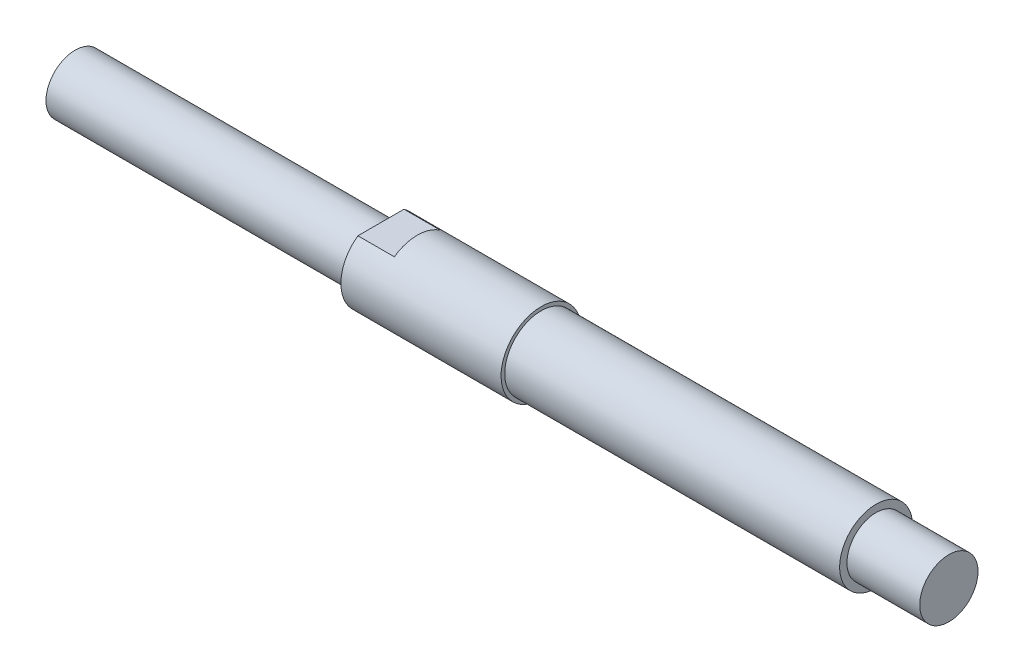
ISO-10303-21;
HEADER;
FILE_DESCRIPTION(('STEP AP214'),'2;1');
FILE_NAME('part.step','',(''),(''),'','','');
FILE_SCHEMA(('AUTOMOTIVE_DESIGN { 1 0 10303 214 1 1 1 1 }'));
ENDSEC;
DATA;
#1=APPLICATION_CONTEXT('core data for automotive mechanical design processes');
#2=APPLICATION_PROTOCOL_DEFINITION('international standard','automotive_design',2000,#1);
#3=PRODUCT_CONTEXT('',#1,'mechanical');
#4=PRODUCT('Part','Part','',(#3));
#5=PRODUCT_RELATED_PRODUCT_CATEGORY('part','',(#4));
#6=PRODUCT_DEFINITION_FORMATION('','',#4);
#7=PRODUCT_DEFINITION_CONTEXT('part definition',#1,'design');
#8=PRODUCT_DEFINITION('design','',#6,#7);
#9=PRODUCT_DEFINITION_SHAPE('','',#8);
#10=(LENGTH_UNIT() NAMED_UNIT(*) SI_UNIT(.MILLI.,.METRE.));
#11=(NAMED_UNIT(*) PLANE_ANGLE_UNIT() SI_UNIT($,.RADIAN.));
#12=(NAMED_UNIT(*) SI_UNIT($,.STERADIAN.) SOLID_ANGLE_UNIT());
#13=UNCERTAINTY_MEASURE_WITH_UNIT(LENGTH_MEASURE(1.E-05),#10,'distance_accuracy_value','');
#14=(GEOMETRIC_REPRESENTATION_CONTEXT(3) GLOBAL_UNCERTAINTY_ASSIGNED_CONTEXT((#13)) GLOBAL_UNIT_ASSIGNED_CONTEXT((#10,
#11,#12)) REPRESENTATION_CONTEXT('',''));
#15=CARTESIAN_POINT('',(0.,0.,0.));
#16=DIRECTION('',(0.,0.,1.));
#17=DIRECTION('',(1.,0.,0.));
#18=AXIS2_PLACEMENT_3D('',#15,#16,#17);
#19=CARTESIAN_POINT('',(-2.91291976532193,0.,0.));
#20=DIRECTION('',(-1.,0.,0.));
#21=DIRECTION('',(0.,0.,1.));
#22=AXIS2_PLACEMENT_3D('',#19,#20,#21);
#23=CYLINDRICAL_SURFACE('',#22,2.75);
#24=CARTESIAN_POINT('',(32.,0.,0.));
#25=DIRECTION('',(1.,0.,0.));
#26=DIRECTION('',(0.,0.,-1.));
#27=AXIS2_PLACEMENT_3D('',#24,#25,#26);
#28=CIRCLE('',#27,2.75);
#29=CARTESIAN_POINT('',(32.,0.,-2.75));
#30=VERTEX_POINT('',#29);
#31=EDGE_CURVE('E127',#30,#30,#28,.T.);
#32=ORIENTED_EDGE('',*,*,#31,.F.);
#33=EDGE_LOOP('',(#32));
#34=FACE_BOUND('',#33,.T.);
#35=CARTESIAN_POINT('',(23.5,0.,0.));
#36=DIRECTION('',(-1.,0.,0.));
#37=DIRECTION('',(0.,0.,1.));
#38=AXIS2_PLACEMENT_3D('',#35,#36,#37);
#39=CIRCLE('',#38,2.75);
#40=CARTESIAN_POINT('',(23.5,2.25,1.58113883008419));
#41=VERTEX_POINT('',#40);
#42=CARTESIAN_POINT('',(23.5,2.25,-1.58113883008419));
#43=VERTEX_POINT('',#42);
#44=EDGE_CURVE('E13',#41,#43,#39,.T.);
#45=ORIENTED_EDGE('',*,*,#44,.F.);
#46=DIRECTION('',(-1.,0.,0.));
#47=VECTOR('',#46,1.);
#48=CARTESIAN_POINT('',(-2.91291976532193,2.25,1.58113883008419));
#49=LINE('',#48,#47);
#50=CARTESIAN_POINT('',(21.,2.25,1.58113883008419));
#51=VERTEX_POINT('',#50);
#52=EDGE_CURVE('E99',#51,#41,#49,.F.);
#53=ORIENTED_EDGE('',*,*,#52,.F.);
#54=CARTESIAN_POINT('',(21.,0.,0.));
#55=DIRECTION('',(-1.,0.,0.));
#56=DIRECTION('',(0.,0.,1.));
#57=AXIS2_PLACEMENT_3D('',#54,#55,#56);
#58=CIRCLE('',#57,2.75);
#59=CARTESIAN_POINT('',(21.,-2.25,1.58113883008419));
#60=VERTEX_POINT('',#59);
#61=EDGE_CURVE('E108',#60,#51,#58,.T.);
#62=ORIENTED_EDGE('',*,*,#61,.F.);
#63=DIRECTION('',(-1.,0.,0.));
#64=VECTOR('',#63,1.);
#65=CARTESIAN_POINT('',(-2.91291976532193,-2.25,1.58113883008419));
#66=LINE('',#65,#64);
#67=CARTESIAN_POINT('',(23.5,-2.25,1.58113883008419));
#68=VERTEX_POINT('',#67);
#69=EDGE_CURVE('E168',#68,#60,#66,.T.);
#70=ORIENTED_EDGE('',*,*,#69,.F.);
#71=CARTESIAN_POINT('',(23.5,0.,0.));
#72=DIRECTION('',(-1.,0.,0.));
#73=DIRECTION('',(0.,0.,1.));
#74=AXIS2_PLACEMENT_3D('',#71,#72,#73);
#75=CIRCLE('',#74,2.75);
#76=CARTESIAN_POINT('',(23.5,-2.25,-1.58113883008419));
#77=VERTEX_POINT('',#76);
#78=EDGE_CURVE('E138',#77,#68,#75,.T.);
#79=ORIENTED_EDGE('',*,*,#78,.F.);
#80=DIRECTION('',(-1.,0.,0.));
#81=VECTOR('',#80,1.);
#82=CARTESIAN_POINT('',(-2.91291976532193,-2.25,-1.58113883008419));
#83=LINE('',#82,#81);
#84=CARTESIAN_POINT('',(21.,-2.25,-1.58113883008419));
#85=VERTEX_POINT('',#84);
#86=EDGE_CURVE('E161',#85,#77,#83,.F.);
#87=ORIENTED_EDGE('',*,*,#86,.F.);
#88=CARTESIAN_POINT('',(21.,2.25,-1.58113883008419));
#89=VERTEX_POINT('',#88);
#90=EDGE_CURVE('E116',#89,#85,#58,.T.);
#91=ORIENTED_EDGE('',*,*,#90,.F.);
#92=DIRECTION('',(-1.,0.,0.));
#93=VECTOR('',#92,1.);
#94=CARTESIAN_POINT('',(-2.91291976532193,2.25,-1.58113883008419));
#95=LINE('',#94,#93);
#96=EDGE_CURVE('E61',#43,#89,#95,.T.);
#97=ORIENTED_EDGE('',*,*,#96,.F.);
#98=EDGE_LOOP('',(#45,#53,#62,#70,#79,#87,#91,#97));
#99=FACE_BOUND('',#98,.T.);
#100=ADVANCED_FACE('F46',(#34,#99),#23,.T.);
#101=CARTESIAN_POINT('',(21.,0.,0.));
#102=DIRECTION('',(-1.,0.,0.));
#103=DIRECTION('',(0.,0.,1.));
#104=AXIS2_PLACEMENT_3D('',#101,#102,#103);
#105=PLANE('',#104);
#106=CARTESIAN_POINT('',(21.,0.,0.));
#107=DIRECTION('',(-1.,0.,0.));
#108=DIRECTION('',(0.,0.,1.));
#109=AXIS2_PLACEMENT_3D('',#106,#107,#108);
#110=CIRCLE('',#109,2.);
#111=CARTESIAN_POINT('',(21.,0.,2.));
#112=VERTEX_POINT('',#111);
#113=EDGE_CURVE('E121',#112,#112,#110,.T.);
#114=ORIENTED_EDGE('',*,*,#113,.F.);
#115=EDGE_LOOP('',(#114));
#116=FACE_BOUND('',#115,.T.);
#117=ORIENTED_EDGE('',*,*,#61,.T.);
#118=DIRECTION('',(0.,0.,-1.));
#119=VECTOR('',#118,1.);
#120=CARTESIAN_POINT('',(21.,2.25,0.));
#121=LINE('',#120,#119);
#122=EDGE_CURVE('E54',#51,#89,#121,.T.);
#123=ORIENTED_EDGE('',*,*,#122,.T.);
#124=ORIENTED_EDGE('',*,*,#90,.T.);
#125=DIRECTION('',(0.,0.,1.));
#126=VECTOR('',#125,1.);
#127=CARTESIAN_POINT('',(21.,-2.25,0.));
#128=LINE('',#127,#126);
#129=EDGE_CURVE('E114',#85,#60,#128,.T.);
#130=ORIENTED_EDGE('',*,*,#129,.T.);
#131=EDGE_LOOP('',(#117,#123,#124,#130));
#132=FACE_BOUND('',#131,.T.);
#133=ADVANCED_FACE('F112',(#116,#132),#105,.T.);
#134=CARTESIAN_POINT('',(32.,0.,0.));
#135=DIRECTION('',(1.,0.,0.));
#136=DIRECTION('',(0.,0.,-1.));
#137=AXIS2_PLACEMENT_3D('',#134,#135,#136);
#138=CYLINDRICAL_SURFACE('',#137,2.5);
#139=CARTESIAN_POINT('',(32.,0.,0.));
#140=DIRECTION('',(1.,0.,0.));
#141=DIRECTION('',(0.,0.,-1.));
#142=AXIS2_PLACEMENT_3D('',#139,#140,#141);
#143=CIRCLE('',#142,2.5);
#144=CARTESIAN_POINT('',(32.,0.,-2.5));
#145=VERTEX_POINT('',#144);
#146=EDGE_CURVE('E119',#145,#145,#143,.T.);
#147=ORIENTED_EDGE('',*,*,#146,.T.);
#148=EDGE_LOOP('',(#147));
#149=FACE_BOUND('',#148,.T.);
#150=CARTESIAN_POINT('',(55.,0.,0.));
#151=DIRECTION('',(1.,0.,0.));
#152=DIRECTION('',(0.,0.,-1.));
#153=AXIS2_PLACEMENT_3D('',#150,#151,#152);
#154=CIRCLE('',#153,2.5);
#155=CARTESIAN_POINT('',(55.,0.,-2.5));
#156=VERTEX_POINT('',#155);
#157=EDGE_CURVE('E115',#156,#156,#154,.T.);
#158=ORIENTED_EDGE('',*,*,#157,.F.);
#159=EDGE_LOOP('',(#158));
#160=FACE_BOUND('',#159,.T.);
#161=CARTESIAN_POINT('',(40.,0.,0.));
#162=DIRECTION('',(-1.,0.,0.));
#163=DIRECTION('',(0.,0.,1.));
#164=AXIS2_PLACEMENT_3D('',#161,#162,#163);
#165=CIRCLE('',#164,2.5);
#166=CARTESIAN_POINT('',(40.,-2.25,1.08972473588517));
#167=VERTEX_POINT('',#166);
#168=CARTESIAN_POINT('',(40.,-2.25,-1.08972473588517));
#169=VERTEX_POINT('',#168);
#170=EDGE_CURVE('E143',#167,#169,#165,.F.);
#171=ORIENTED_EDGE('',*,*,#170,.T.);
#172=DIRECTION('',(1.,0.,0.));
#173=VECTOR('',#172,1.);
#174=CARTESIAN_POINT('',(32.,-2.25,-1.08972473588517));
#175=LINE('',#174,#173);
#176=CARTESIAN_POINT('',(36.5,-2.25,-1.08972473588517));
#177=VERTEX_POINT('',#176);
#178=EDGE_CURVE('E104',#169,#177,#175,.F.);
#179=ORIENTED_EDGE('',*,*,#178,.T.);
#180=CARTESIAN_POINT('',(36.5,0.,0.));
#181=DIRECTION('',(1.,0.,0.));
#182=DIRECTION('',(0.,0.,-1.));
#183=AXIS2_PLACEMENT_3D('',#180,#181,#182);
#184=CIRCLE('',#183,2.5);
#185=CARTESIAN_POINT('',(36.5,-2.25,1.08972473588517));
#186=VERTEX_POINT('',#185);
#187=EDGE_CURVE('E146',#177,#186,#184,.F.);
#188=ORIENTED_EDGE('',*,*,#187,.T.);
#189=DIRECTION('',(1.,0.,0.));
#190=VECTOR('',#189,1.);
#191=CARTESIAN_POINT('',(32.,-2.25,1.08972473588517));
#192=LINE('',#191,#190);
#193=EDGE_CURVE('E140',#186,#167,#192,.T.);
#194=ORIENTED_EDGE('',*,*,#193,.T.);
#195=EDGE_LOOP('',(#171,#179,#188,#194));
#196=FACE_BOUND('',#195,.T.);
#197=ADVANCED_FACE('F151',(#149,#160,#196),#138,.T.);
#198=CARTESIAN_POINT('',(55.,0.,0.));
#199=DIRECTION('',(1.,0.,0.));
#200=DIRECTION('',(0.,0.,-1.));
#201=AXIS2_PLACEMENT_3D('',#198,#199,#200);
#202=PLANE('',#201);
#203=CARTESIAN_POINT('',(55.,0.,0.));
#204=DIRECTION('',(1.,0.,0.));
#205=DIRECTION('',(0.,0.,-1.));
#206=AXIS2_PLACEMENT_3D('',#203,#204,#205);
#207=CIRCLE('',#206,2.);
#208=CARTESIAN_POINT('',(55.,0.,-2.));
#209=VERTEX_POINT('',#208);
#210=EDGE_CURVE('E132',#209,#209,#207,.T.);
#211=ORIENTED_EDGE('',*,*,#210,.F.);
#212=EDGE_LOOP('',(#211));
#213=FACE_BOUND('',#212,.T.);
#214=ORIENTED_EDGE('',*,*,#157,.T.);
#215=EDGE_LOOP('',(#214));
#216=FACE_BOUND('',#215,.T.);
#217=ADVANCED_FACE('F202',(#213,#216),#202,.T.);
#218=CARTESIAN_POINT('',(55.,0.,0.));
#219=DIRECTION('',(1.,0.,0.));
#220=DIRECTION('',(0.,0.,-1.));
#221=AXIS2_PLACEMENT_3D('',#218,#219,#220);
#222=CYLINDRICAL_SURFACE('',#221,2.);
#223=ORIENTED_EDGE('',*,*,#210,.T.);
#224=EDGE_LOOP('',(#223));
#225=FACE_BOUND('',#224,.T.);
#226=CARTESIAN_POINT('',(60.,0.,0.));
#227=DIRECTION('',(1.,0.,0.));
#228=DIRECTION('',(0.,0.,-1.));
#229=AXIS2_PLACEMENT_3D('',#226,#227,#228);
#230=CIRCLE('',#229,2.);
#231=CARTESIAN_POINT('',(60.,0.,-2.));
#232=VERTEX_POINT('',#231);
#233=EDGE_CURVE('E131',#232,#232,#230,.T.);
#234=ORIENTED_EDGE('',*,*,#233,.F.);
#235=EDGE_LOOP('',(#234));
#236=FACE_BOUND('',#235,.T.);
#237=ADVANCED_FACE('F200',(#225,#236),#222,.T.);
#238=CARTESIAN_POINT('',(60.,0.,0.));
#239=DIRECTION('',(-1.,0.,0.));
#240=DIRECTION('',(0.,0.,1.));
#241=AXIS2_PLACEMENT_3D('',#238,#239,#240);
#242=PLANE('',#241);
#243=ORIENTED_EDGE('',*,*,#233,.T.);
#244=EDGE_LOOP('',(#243));
#245=FACE_BOUND('',#244,.T.);
#246=ADVANCED_FACE('F185',(#245),#242,.F.);
#247=CARTESIAN_POINT('',(32.,0.,0.));
#248=DIRECTION('',(1.,0.,0.));
#249=DIRECTION('',(0.,0.,-1.));
#250=AXIS2_PLACEMENT_3D('',#247,#248,#249);
#251=PLANE('',#250);
#252=ORIENTED_EDGE('',*,*,#146,.F.);
#253=EDGE_LOOP('',(#252));
#254=FACE_BOUND('',#253,.T.);
#255=ORIENTED_EDGE('',*,*,#31,.T.);
#256=EDGE_LOOP('',(#255));
#257=FACE_BOUND('',#256,.T.);
#258=ADVANCED_FACE('F178',(#254,#257),#251,.T.);
#259=CARTESIAN_POINT('',(21.,0.,0.));
#260=DIRECTION('',(-1.,0.,0.));
#261=DIRECTION('',(0.,0.,1.));
#262=AXIS2_PLACEMENT_3D('',#259,#260,#261);
#263=CYLINDRICAL_SURFACE('',#262,2.);
#264=CARTESIAN_POINT('',(0.,0.,0.));
#265=DIRECTION('',(-1.,0.,0.));
#266=DIRECTION('',(0.,0.,1.));
#267=AXIS2_PLACEMENT_3D('',#264,#265,#266);
#268=CIRCLE('',#267,2.);
#269=CARTESIAN_POINT('',(0.,0.,2.));
#270=VERTEX_POINT('',#269);
#271=EDGE_CURVE('E124',#270,#270,#268,.T.);
#272=CARTESIAN_POINT('',(21.,0.,2.));
#273=CARTESIAN_POINT('',(20.78125,0.,2.));
#274=CARTESIAN_POINT('',(20.5625,0.,2.));
#275=CARTESIAN_POINT('',(20.125,0.,2.));
#276=CARTESIAN_POINT('',(19.90625,0.,2.));
#277=CARTESIAN_POINT('',(19.46875,0.,2.));
#278=CARTESIAN_POINT('',(19.25,0.,2.));
#279=CARTESIAN_POINT('',(18.8125,0.,2.));
#280=CARTESIAN_POINT('',(18.59375,0.,2.));
#281=CARTESIAN_POINT('',(18.15625,0.,2.));
#282=CARTESIAN_POINT('',(17.9375,0.,2.));
#283=CARTESIAN_POINT('',(17.5,0.,2.));
#284=CARTESIAN_POINT('',(17.28125,0.,2.));
#285=CARTESIAN_POINT('',(16.84375,0.,2.));
#286=CARTESIAN_POINT('',(16.625,0.,2.));
#287=CARTESIAN_POINT('',(16.1875,0.,2.));
#288=CARTESIAN_POINT('',(15.96875,0.,2.));
#289=CARTESIAN_POINT('',(15.53125,0.,2.));
#290=CARTESIAN_POINT('',(15.3125,0.,2.));
#291=CARTESIAN_POINT('',(14.875,0.,2.));
#292=CARTESIAN_POINT('',(14.65625,0.,2.));
#293=CARTESIAN_POINT('',(14.21875,0.,2.));
#294=CARTESIAN_POINT('',(14.,0.,2.));
#295=CARTESIAN_POINT('',(13.5625,0.,2.));
#296=CARTESIAN_POINT('',(13.34375,0.,2.));
#297=CARTESIAN_POINT('',(12.90625,0.,2.));
#298=CARTESIAN_POINT('',(12.6875,0.,2.));
#299=CARTESIAN_POINT('',(12.25,0.,2.));
#300=CARTESIAN_POINT('',(12.03125,0.,2.));
#301=CARTESIAN_POINT('',(11.59375,0.,2.));
#302=CARTESIAN_POINT('',(11.375,0.,2.));
#303=CARTESIAN_POINT('',(10.9375,0.,2.));
#304=CARTESIAN_POINT('',(10.71875,0.,2.));
#305=CARTESIAN_POINT('',(10.28125,0.,2.));
#306=CARTESIAN_POINT('',(10.0625,0.,2.));
#307=CARTESIAN_POINT('',(9.625,0.,2.));
#308=CARTESIAN_POINT('',(9.40625,0.,2.));
#309=CARTESIAN_POINT('',(8.96875,0.,2.));
#310=CARTESIAN_POINT('',(8.75,0.,2.));
#311=CARTESIAN_POINT('',(8.3125,0.,2.));
#312=CARTESIAN_POINT('',(8.09375,0.,2.));
#313=CARTESIAN_POINT('',(7.65625,0.,2.));
#314=CARTESIAN_POINT('',(7.4375,0.,2.));
#315=CARTESIAN_POINT('',(7.,0.,2.));
#316=CARTESIAN_POINT('',(6.78125,0.,2.));
#317=CARTESIAN_POINT('',(6.34375,0.,2.));
#318=CARTESIAN_POINT('',(6.125,0.,2.));
#319=CARTESIAN_POINT('',(5.6875,0.,2.));
#320=CARTESIAN_POINT('',(5.46875,0.,2.));
#321=CARTESIAN_POINT('',(5.03125,0.,2.));
#322=CARTESIAN_POINT('',(4.8125,0.,2.));
#323=CARTESIAN_POINT('',(4.375,0.,2.));
#324=CARTESIAN_POINT('',(4.15625,0.,2.));
#325=CARTESIAN_POINT('',(3.71875,0.,2.));
#326=CARTESIAN_POINT('',(3.5,0.,2.));
#327=CARTESIAN_POINT('',(3.0625,0.,2.));
#328=CARTESIAN_POINT('',(2.84375,0.,2.));
#329=CARTESIAN_POINT('',(2.40625,0.,2.));
#330=CARTESIAN_POINT('',(2.1875,0.,2.));
#331=CARTESIAN_POINT('',(1.75,0.,2.));
#332=CARTESIAN_POINT('',(1.53125,0.,2.));
#333=CARTESIAN_POINT('',(1.09375,0.,2.));
#334=CARTESIAN_POINT('',(0.875000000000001,0.,2.));
#335=CARTESIAN_POINT('',(0.4375,0.,2.));
#336=CARTESIAN_POINT('',(0.21875,0.,2.));
#337=CARTESIAN_POINT('',(0.,0.,2.));
#338=B_SPLINE_CURVE_WITH_KNOTS('',3,(#272,#273,#274,#275,#276,#277,#278,#279,#280,#281,#282,
#283,#284,#285,#286,#287,#288,#289,#290,#291,#292,#293,#294,#295,#296,#297,#298,#299,#300,#301,
#302,#303,#304,#305,#306,#307,#308,#309,#310,#311,#312,#313,#314,#315,#316,#317,#318,#319,#320,
#321,#322,#323,#324,#325,#326,#327,#328,#329,#330,#331,#332,#333,#334,#335,#336,#337),
.UNSPECIFIED.,.F.,.F.,(4,2,2,2,2,2,2,2,2,2,2,2,2,2,2,2,2,2,2,2,2,2,2,2,2,2,2,2,2,2,2,2,4),(0.,
0.656250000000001,1.3125,1.96875,2.625,3.28125,3.9375,4.59375,5.25,5.90625,6.5625,7.21875,7.875,
8.53125,9.1875,9.84375,10.5,11.15625,11.8125,12.46875,13.125,13.78125,14.4375,15.09375,15.75,
16.40625,17.0625,17.71875,18.375,19.03125,19.6875,20.34375,21.),.UNSPECIFIED.);
#339=EDGE_CURVE('BSEAM176',#112,#270,#338,.T.);
#340=ORIENTED_EDGE('',*,*,#113,.T.);
#341=ORIENTED_EDGE('',*,*,#271,.F.);
#342=ORIENTED_EDGE('',*,*,#339,.T.);
#343=ORIENTED_EDGE('',*,*,#339,.F.);
#344=EDGE_LOOP('',(#340,#342,#341,#343));
#345=FACE_BOUND('',#344,.T.);
#346=ADVANCED_FACE('F176',(#345),#263,.T.);
#347=CARTESIAN_POINT('',(0.,0.,0.));
#348=DIRECTION('',(1.,0.,0.));
#349=DIRECTION('',(0.,0.,-1.));
#350=AXIS2_PLACEMENT_3D('',#347,#348,#349);
#351=PLANE('',#350);
#352=ORIENTED_EDGE('',*,*,#271,.T.);
#353=EDGE_LOOP('',(#352));
#354=FACE_BOUND('',#353,.T.);
#355=ADVANCED_FACE('F48',(#354),#351,.F.);
#356=CARTESIAN_POINT('',(23.5,-2.25,2.75));
#357=DIRECTION('',(-1.,0.,0.));
#358=DIRECTION('',(0.,0.,1.));
#359=AXIS2_PLACEMENT_3D('',#356,#357,#358);
#360=PLANE('',#359);
#361=DIRECTION('',(0.,0.,-1.));
#362=VECTOR('',#361,1.);
#363=CARTESIAN_POINT('',(23.5,-2.25,2.75));
#364=LINE('',#363,#362);
#365=EDGE_CURVE('E158',#68,#77,#364,.T.);
#366=ORIENTED_EDGE('',*,*,#365,.T.);
#367=ORIENTED_EDGE('',*,*,#78,.T.);
#368=EDGE_LOOP('',(#366,#367));
#369=FACE_BOUND('',#368,.T.);
#370=ADVANCED_FACE('F184',(#369),#360,.T.);
#371=CARTESIAN_POINT('',(0.,-2.25,0.));
#372=DIRECTION('',(0.,-1.,0.));
#373=DIRECTION('',(0.,0.,-1.));
#374=AXIS2_PLACEMENT_3D('',#371,#372,#373);
#375=PLANE('',#374);
#376=ORIENTED_EDGE('',*,*,#69,.T.);
#377=ORIENTED_EDGE('',*,*,#129,.F.);
#378=ORIENTED_EDGE('',*,*,#86,.T.);
#379=ORIENTED_EDGE('',*,*,#365,.F.);
#380=EDGE_LOOP('',(#376,#377,#378,#379));
#381=FACE_BOUND('',#380,.T.);
#382=ADVANCED_FACE('F258',(#381),#375,.T.);
#383=CARTESIAN_POINT('',(36.5,-2.25,2.5));
#384=DIRECTION('',(1.,0.,0.));
#385=DIRECTION('',(0.,0.,-1.));
#386=AXIS2_PLACEMENT_3D('',#383,#384,#385);
#387=PLANE('',#386);
#388=DIRECTION('',(0.,0.,1.));
#389=VECTOR('',#388,1.);
#390=CARTESIAN_POINT('',(36.5,-2.25,2.5));
#391=LINE('',#390,#389);
#392=EDGE_CURVE('E155',#177,#186,#391,.T.);
#393=ORIENTED_EDGE('',*,*,#392,.T.);
#394=ORIENTED_EDGE('',*,*,#187,.F.);
#395=EDGE_LOOP('',(#393,#394));
#396=FACE_BOUND('',#395,.T.);
#397=ADVANCED_FACE('F266',(#396),#387,.T.);
#398=CARTESIAN_POINT('',(40.,-2.25,2.5));
#399=DIRECTION('',(-1.,0.,0.));
#400=DIRECTION('',(0.,0.,1.));
#401=AXIS2_PLACEMENT_3D('',#398,#399,#400);
#402=PLANE('',#401);
#403=DIRECTION('',(0.,0.,-1.));
#404=VECTOR('',#403,1.);
#405=CARTESIAN_POINT('',(40.,-2.25,2.5));
#406=LINE('',#405,#404);
#407=EDGE_CURVE('E69',#167,#169,#406,.T.);
#408=ORIENTED_EDGE('',*,*,#407,.T.);
#409=ORIENTED_EDGE('',*,*,#170,.F.);
#410=EDGE_LOOP('',(#408,#409));
#411=FACE_BOUND('',#410,.T.);
#412=ADVANCED_FACE('F157',(#411),#402,.T.);
#413=CARTESIAN_POINT('',(0.,-2.25,0.));
#414=DIRECTION('',(0.,-1.,0.));
#415=DIRECTION('',(0.,0.,-1.));
#416=AXIS2_PLACEMENT_3D('',#413,#414,#415);
#417=PLANE('',#416);
#418=ORIENTED_EDGE('',*,*,#407,.F.);
#419=ORIENTED_EDGE('',*,*,#193,.F.);
#420=ORIENTED_EDGE('',*,*,#392,.F.);
#421=ORIENTED_EDGE('',*,*,#178,.F.);
#422=EDGE_LOOP('',(#418,#419,#420,#421));
#423=FACE_BOUND('',#422,.T.);
#424=ADVANCED_FACE('F153',(#423),#417,.T.);
#425=CARTESIAN_POINT('',(23.5,2.25,-2.75));
#426=DIRECTION('',(-1.,0.,0.));
#427=DIRECTION('',(0.,0.,1.));
#428=AXIS2_PLACEMENT_3D('',#425,#426,#427);
#429=PLANE('',#428);
#430=DIRECTION('',(0.,0.,1.));
#431=VECTOR('',#430,1.);
#432=CARTESIAN_POINT('',(23.5,2.25,-2.75));
#433=LINE('',#432,#431);
#434=EDGE_CURVE('E109',#43,#41,#433,.T.);
#435=ORIENTED_EDGE('',*,*,#434,.T.);
#436=ORIENTED_EDGE('',*,*,#44,.T.);
#437=EDGE_LOOP('',(#435,#436));
#438=FACE_BOUND('',#437,.T.);
#439=ADVANCED_FACE('F288',(#438),#429,.T.);
#440=CARTESIAN_POINT('',(0.,2.25,0.));
#441=DIRECTION('',(0.,1.,0.));
#442=DIRECTION('',(0.,0.,1.));
#443=AXIS2_PLACEMENT_3D('',#440,#441,#442);
#444=PLANE('',#443);
#445=ORIENTED_EDGE('',*,*,#96,.T.);
#446=ORIENTED_EDGE('',*,*,#122,.F.);
#447=ORIENTED_EDGE('',*,*,#52,.T.);
#448=ORIENTED_EDGE('',*,*,#434,.F.);
#449=EDGE_LOOP('',(#445,#446,#447,#448));
#450=FACE_BOUND('',#449,.T.);
#451=ADVANCED_FACE('F98',(#450),#444,.T.);
#452=CLOSED_SHELL('',(#100,#133,#197,#217,#237,#246,#258,#346,#355,#370,#382,#397,#412,#424,
#439,#451));
#453=MANIFOLD_SOLID_BREP('B2',#452);
#454=ADVANCED_BREP_SHAPE_REPRESENTATION('',(#18,#453),#14);
#455=SHAPE_DEFINITION_REPRESENTATION(#9,#454);
ENDSEC;
END-ISO-10303-21;
